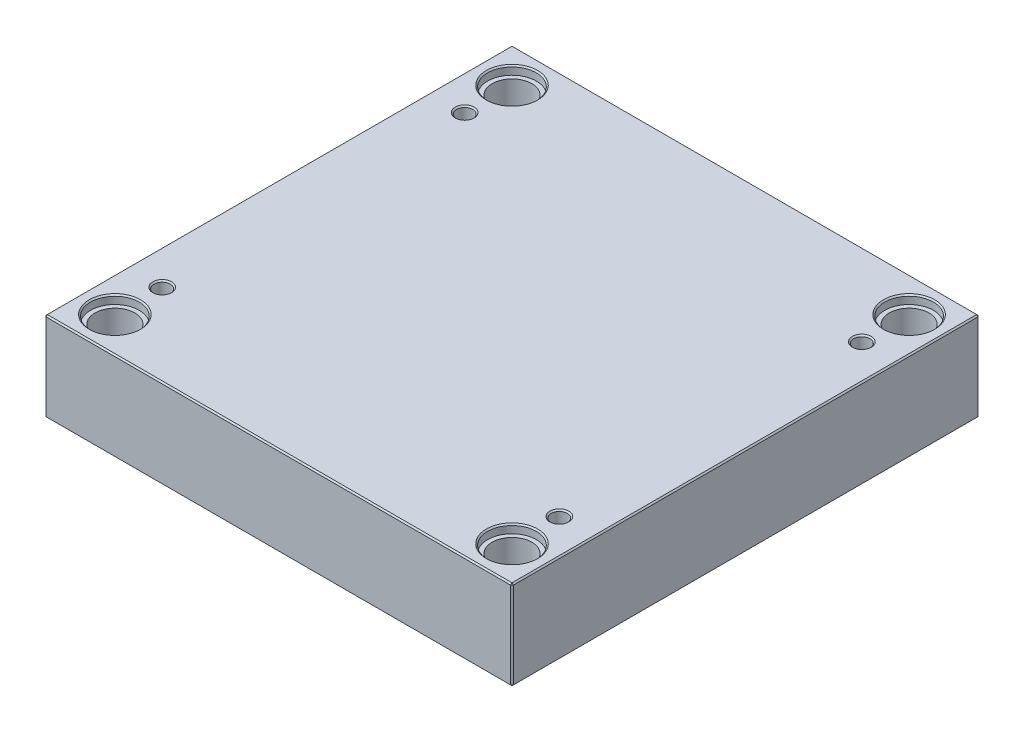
ISO-10303-21;
HEADER;
FILE_DESCRIPTION(('STEP AP214'),'2;1');
FILE_NAME('part.step','',(''),(''),'','','');
FILE_SCHEMA(('AUTOMOTIVE_DESIGN { 1 0 10303 214 1 1 1 1 }'));
ENDSEC;
DATA;
#1=APPLICATION_CONTEXT('core data for automotive mechanical design processes');
#2=APPLICATION_PROTOCOL_DEFINITION('international standard','automotive_design',2000,#1);
#3=PRODUCT_CONTEXT('',#1,'mechanical');
#4=PRODUCT('Part','Part','',(#3));
#5=PRODUCT_RELATED_PRODUCT_CATEGORY('part','',(#4));
#6=PRODUCT_DEFINITION_FORMATION('','',#4);
#7=PRODUCT_DEFINITION_CONTEXT('part definition',#1,'design');
#8=PRODUCT_DEFINITION('design','',#6,#7);
#9=PRODUCT_DEFINITION_SHAPE('','',#8);
#10=(LENGTH_UNIT() NAMED_UNIT(*) SI_UNIT(.MILLI.,.METRE.));
#11=(NAMED_UNIT(*) PLANE_ANGLE_UNIT() SI_UNIT($,.RADIAN.));
#12=(NAMED_UNIT(*) SI_UNIT($,.STERADIAN.) SOLID_ANGLE_UNIT());
#13=UNCERTAINTY_MEASURE_WITH_UNIT(LENGTH_MEASURE(1.E-05),#10,'distance_accuracy_value','');
#14=(GEOMETRIC_REPRESENTATION_CONTEXT(3) GLOBAL_UNCERTAINTY_ASSIGNED_CONTEXT((#13)) GLOBAL_UNIT_ASSIGNED_CONTEXT((#10,
#11,#12)) REPRESENTATION_CONTEXT('',''));
#15=CARTESIAN_POINT('',(0.,0.,0.));
#16=DIRECTION('',(0.,0.,1.));
#17=DIRECTION('',(1.,0.,0.));
#18=AXIS2_PLACEMENT_3D('',#15,#16,#17);
#19=CARTESIAN_POINT('',(-147.,0.,-147.));
#20=DIRECTION('',(0.,1.,0.));
#21=DIRECTION('',(0.,0.,1.));
#22=AXIS2_PLACEMENT_3D('',#19,#20,#21);
#23=CYLINDRICAL_SURFACE('',#22,14.7);
#24=CARTESIAN_POINT('',(-147.,0.999999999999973,-147.));
#25=DIRECTION('',(0.,1.,0.));
#26=DIRECTION('',(0.,0.,1.));
#27=AXIS2_PLACEMENT_3D('',#24,#25,#26);
#28=CIRCLE('',#27,14.7);
#29=CARTESIAN_POINT('',(-147.,0.999999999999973,-132.3));
#30=VERTEX_POINT('',#29);
#31=EDGE_CURVE('E472',#30,#30,#28,.F.);
#32=ORIENTED_EDGE('',*,*,#31,.T.);
#33=EDGE_LOOP('',(#32));
#34=FACE_BOUND('',#33,.T.);
#35=CARTESIAN_POINT('',(-147.,59.7,-147.));
#36=DIRECTION('',(0.,1.,0.));
#37=DIRECTION('',(0.,0.,1.));
#38=AXIS2_PLACEMENT_3D('',#35,#36,#37);
#39=CIRCLE('',#38,14.7);
#40=CARTESIAN_POINT('',(-147.,59.7,-132.3));
#41=VERTEX_POINT('',#40);
#42=EDGE_CURVE('E221',#41,#41,#39,.F.);
#43=ORIENTED_EDGE('',*,*,#42,.F.);
#44=EDGE_LOOP('',(#43));
#45=FACE_BOUND('',#44,.T.);
#46=ADVANCED_FACE('F16',(#34,#45),#23,.F.);
#47=CARTESIAN_POINT('',(147.,0.,-147.));
#48=DIRECTION('',(0.,1.,0.));
#49=DIRECTION('',(0.,0.,1.));
#50=AXIS2_PLACEMENT_3D('',#47,#48,#49);
#51=CYLINDRICAL_SURFACE('',#50,14.7);
#52=CARTESIAN_POINT('',(147.,0.999999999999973,-147.));
#53=DIRECTION('',(0.,1.,0.));
#54=DIRECTION('',(0.,0.,1.));
#55=AXIS2_PLACEMENT_3D('',#52,#53,#54);
#56=CIRCLE('',#55,14.7);
#57=CARTESIAN_POINT('',(147.,0.999999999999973,-132.3));
#58=VERTEX_POINT('',#57);
#59=EDGE_CURVE('E474',#58,#58,#56,.F.);
#60=ORIENTED_EDGE('',*,*,#59,.T.);
#61=EDGE_LOOP('',(#60));
#62=FACE_BOUND('',#61,.T.);
#63=CARTESIAN_POINT('',(147.,59.7,-147.));
#64=DIRECTION('',(0.,1.,0.));
#65=DIRECTION('',(0.,0.,1.));
#66=AXIS2_PLACEMENT_3D('',#63,#64,#65);
#67=CIRCLE('',#66,14.7);
#68=CARTESIAN_POINT('',(147.,59.7,-132.3));
#69=VERTEX_POINT('',#68);
#70=EDGE_CURVE('E218',#69,#69,#67,.F.);
#71=ORIENTED_EDGE('',*,*,#70,.F.);
#72=EDGE_LOOP('',(#71));
#73=FACE_BOUND('',#72,.T.);
#74=ADVANCED_FACE('F263',(#62,#73),#51,.F.);
#75=CARTESIAN_POINT('',(147.,0.,147.));
#76=DIRECTION('',(0.,1.,0.));
#77=DIRECTION('',(0.,0.,1.));
#78=AXIS2_PLACEMENT_3D('',#75,#76,#77);
#79=CYLINDRICAL_SURFACE('',#78,14.7);
#80=CARTESIAN_POINT('',(147.,0.999999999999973,147.));
#81=DIRECTION('',(0.,1.,0.));
#82=DIRECTION('',(0.,0.,1.));
#83=AXIS2_PLACEMENT_3D('',#80,#81,#82);
#84=CIRCLE('',#83,14.7);
#85=CARTESIAN_POINT('',(147.,0.999999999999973,161.7));
#86=VERTEX_POINT('',#85);
#87=EDGE_CURVE('E477',#86,#86,#84,.F.);
#88=ORIENTED_EDGE('',*,*,#87,.T.);
#89=EDGE_LOOP('',(#88));
#90=FACE_BOUND('',#89,.T.);
#91=CARTESIAN_POINT('',(147.,59.7,147.));
#92=DIRECTION('',(0.,1.,0.));
#93=DIRECTION('',(0.,0.,1.));
#94=AXIS2_PLACEMENT_3D('',#91,#92,#93);
#95=CIRCLE('',#94,14.7);
#96=CARTESIAN_POINT('',(147.,59.7,161.7));
#97=VERTEX_POINT('',#96);
#98=EDGE_CURVE('E214',#97,#97,#95,.F.);
#99=ORIENTED_EDGE('',*,*,#98,.F.);
#100=EDGE_LOOP('',(#99));
#101=FACE_BOUND('',#100,.T.);
#102=ADVANCED_FACE('F270',(#90,#101),#79,.F.);
#103=CARTESIAN_POINT('',(-147.,0.,147.));
#104=DIRECTION('',(0.,1.,0.));
#105=DIRECTION('',(0.,0.,1.));
#106=AXIS2_PLACEMENT_3D('',#103,#104,#105);
#107=CYLINDRICAL_SURFACE('',#106,14.7);
#108=CARTESIAN_POINT('',(-147.,0.999999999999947,147.));
#109=DIRECTION('',(0.,1.,0.));
#110=DIRECTION('',(0.,0.,1.));
#111=AXIS2_PLACEMENT_3D('',#108,#109,#110);
#112=CIRCLE('',#111,14.7);
#113=CARTESIAN_POINT('',(-147.,0.999999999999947,161.7));
#114=VERTEX_POINT('',#113);
#115=EDGE_CURVE('E480',#114,#114,#112,.F.);
#116=ORIENTED_EDGE('',*,*,#115,.T.);
#117=EDGE_LOOP('',(#116));
#118=FACE_BOUND('',#117,.T.);
#119=CARTESIAN_POINT('',(-147.,59.7,147.));
#120=DIRECTION('',(0.,1.,0.));
#121=DIRECTION('',(0.,0.,1.));
#122=AXIS2_PLACEMENT_3D('',#119,#120,#121);
#123=CIRCLE('',#122,14.7);
#124=CARTESIAN_POINT('',(-147.,59.7,161.7));
#125=VERTEX_POINT('',#124);
#126=EDGE_CURVE('E211',#125,#125,#123,.F.);
#127=ORIENTED_EDGE('',*,*,#126,.F.);
#128=EDGE_LOOP('',(#127));
#129=FACE_BOUND('',#128,.T.);
#130=ADVANCED_FACE('F277',(#118,#129),#107,.F.);
#131=CARTESIAN_POINT('',(-173.,66.,173.));
#132=DIRECTION('',(1.,0.,0.));
#133=DIRECTION('',(0.,0.,-1.));
#134=AXIS2_PLACEMENT_3D('',#131,#132,#133);
#135=PLANE('',#134);
#136=DIRECTION('',(0.,-1.,0.));
#137=VECTOR('',#136,1.);
#138=CARTESIAN_POINT('',(-173.,66.,-172.));
#139=LINE('',#138,#137);
#140=CARTESIAN_POINT('',(-173.,65.,-172.));
#141=VERTEX_POINT('',#140);
#142=CARTESIAN_POINT('',(-173.,1.,-172.));
#143=VERTEX_POINT('',#142);
#144=EDGE_CURVE('E487',#141,#143,#139,.T.);
#145=ORIENTED_EDGE('',*,*,#144,.T.);
#146=DIRECTION('',(0.,0.,1.));
#147=VECTOR('',#146,1.);
#148=CARTESIAN_POINT('',(-173.,1.,173.));
#149=LINE('',#148,#147);
#150=CARTESIAN_POINT('',(-173.,1.,172.));
#151=VERTEX_POINT('',#150);
#152=EDGE_CURVE('E490',#143,#151,#149,.T.);
#153=ORIENTED_EDGE('',*,*,#152,.T.);
#154=DIRECTION('',(0.,1.,0.));
#155=VECTOR('',#154,1.);
#156=CARTESIAN_POINT('',(-173.,66.,172.));
#157=LINE('',#156,#155);
#158=CARTESIAN_POINT('',(-173.,65.,172.));
#159=VERTEX_POINT('',#158);
#160=EDGE_CURVE('E485',#151,#159,#157,.T.);
#161=ORIENTED_EDGE('',*,*,#160,.T.);
#162=DIRECTION('',(0.,0.,-1.));
#163=VECTOR('',#162,1.);
#164=CARTESIAN_POINT('',(-173.,65.,-173.));
#165=LINE('',#164,#163);
#166=EDGE_CURVE('E483',#159,#141,#165,.T.);
#167=ORIENTED_EDGE('',*,*,#166,.T.);
#168=EDGE_LOOP('',(#145,#153,#161,#167));
#169=FACE_BOUND('',#168,.T.);
#170=ADVANCED_FACE('F298',(#169),#135,.F.);
#171=CARTESIAN_POINT('',(173.,66.,173.));
#172=DIRECTION('',(0.,0.,-1.));
#173=DIRECTION('',(-1.,0.,0.));
#174=AXIS2_PLACEMENT_3D('',#171,#172,#173);
#175=PLANE('',#174);
#176=DIRECTION('',(-1.,0.,0.));
#177=VECTOR('',#176,1.);
#178=CARTESIAN_POINT('',(-173.,65.,173.));
#179=LINE('',#178,#177);
#180=CARTESIAN_POINT('',(172.,65.,173.));
#181=VERTEX_POINT('',#180);
#182=CARTESIAN_POINT('',(-172.,65.,173.));
#183=VERTEX_POINT('',#182);
#184=EDGE_CURVE('E509',#181,#183,#179,.T.);
#185=ORIENTED_EDGE('',*,*,#184,.T.);
#186=DIRECTION('',(0.,-1.,0.));
#187=VECTOR('',#186,1.);
#188=CARTESIAN_POINT('',(-172.,66.,173.));
#189=LINE('',#188,#187);
#190=CARTESIAN_POINT('',(-172.,1.,173.));
#191=VERTEX_POINT('',#190);
#192=EDGE_CURVE('E515',#183,#191,#189,.T.);
#193=ORIENTED_EDGE('',*,*,#192,.T.);
#194=DIRECTION('',(1.,0.,0.));
#195=VECTOR('',#194,1.);
#196=CARTESIAN_POINT('',(173.,1.,173.));
#197=LINE('',#196,#195);
#198=CARTESIAN_POINT('',(172.,1.,173.));
#199=VERTEX_POINT('',#198);
#200=EDGE_CURVE('E513',#191,#199,#197,.T.);
#201=ORIENTED_EDGE('',*,*,#200,.T.);
#202=DIRECTION('',(0.,1.,0.));
#203=VECTOR('',#202,1.);
#204=CARTESIAN_POINT('',(172.,66.,173.));
#205=LINE('',#204,#203);
#206=EDGE_CURVE('E511',#199,#181,#205,.T.);
#207=ORIENTED_EDGE('',*,*,#206,.T.);
#208=EDGE_LOOP('',(#185,#193,#201,#207));
#209=FACE_BOUND('',#208,.T.);
#210=ADVANCED_FACE('F294',(#209),#175,.F.);
#211=CARTESIAN_POINT('',(173.,66.,173.));
#212=DIRECTION('',(-1.,0.,0.));
#213=DIRECTION('',(0.,0.,1.));
#214=AXIS2_PLACEMENT_3D('',#211,#212,#213);
#215=PLANE('',#214);
#216=DIRECTION('',(0.,0.,-1.));
#217=VECTOR('',#216,1.);
#218=CARTESIAN_POINT('',(173.,1.,173.));
#219=LINE('',#218,#217);
#220=CARTESIAN_POINT('',(173.,1.,172.));
#221=VERTEX_POINT('',#220);
#222=CARTESIAN_POINT('',(173.,1.,-172.));
#223=VERTEX_POINT('',#222);
#224=EDGE_CURVE('E504',#221,#223,#219,.T.);
#225=ORIENTED_EDGE('',*,*,#224,.T.);
#226=DIRECTION('',(0.,1.,0.));
#227=VECTOR('',#226,1.);
#228=CARTESIAN_POINT('',(173.,66.,-172.));
#229=LINE('',#228,#227);
#230=CARTESIAN_POINT('',(173.,65.,-172.));
#231=VERTEX_POINT('',#230);
#232=EDGE_CURVE('E506',#223,#231,#229,.T.);
#233=ORIENTED_EDGE('',*,*,#232,.T.);
#234=DIRECTION('',(0.,0.,1.));
#235=VECTOR('',#234,1.);
#236=CARTESIAN_POINT('',(173.,65.,173.));
#237=LINE('',#236,#235);
#238=CARTESIAN_POINT('',(173.,65.,172.));
#239=VERTEX_POINT('',#238);
#240=EDGE_CURVE('E500',#231,#239,#237,.T.);
#241=ORIENTED_EDGE('',*,*,#240,.T.);
#242=DIRECTION('',(0.,-1.,0.));
#243=VECTOR('',#242,1.);
#244=CARTESIAN_POINT('',(173.,66.,172.));
#245=LINE('',#244,#243);
#246=EDGE_CURVE('E502',#239,#221,#245,.T.);
#247=ORIENTED_EDGE('',*,*,#246,.T.);
#248=EDGE_LOOP('',(#225,#233,#241,#247));
#249=FACE_BOUND('',#248,.T.);
#250=ADVANCED_FACE('F290',(#249),#215,.F.);
#251=CARTESIAN_POINT('',(173.,66.,-173.));
#252=DIRECTION('',(0.,0.,1.));
#253=DIRECTION('',(1.,0.,0.));
#254=AXIS2_PLACEMENT_3D('',#251,#252,#253);
#255=PLANE('',#254);
#256=DIRECTION('',(0.,-1.,0.));
#257=VECTOR('',#256,1.);
#258=CARTESIAN_POINT('',(172.,66.,-173.));
#259=LINE('',#258,#257);
#260=CARTESIAN_POINT('',(172.,65.,-173.));
#261=VERTEX_POINT('',#260);
#262=CARTESIAN_POINT('',(172.,1.,-173.));
#263=VERTEX_POINT('',#262);
#264=EDGE_CURVE('E494',#261,#263,#259,.T.);
#265=ORIENTED_EDGE('',*,*,#264,.T.);
#266=DIRECTION('',(-1.,0.,0.));
#267=VECTOR('',#266,1.);
#268=CARTESIAN_POINT('',(173.,1.,-173.));
#269=LINE('',#268,#267);
#270=CARTESIAN_POINT('',(-172.,1.,-173.));
#271=VERTEX_POINT('',#270);
#272=EDGE_CURVE('E138',#263,#271,#269,.T.);
#273=ORIENTED_EDGE('',*,*,#272,.T.);
#274=DIRECTION('',(0.,1.,0.));
#275=VECTOR('',#274,1.);
#276=CARTESIAN_POINT('',(-172.,66.,-173.));
#277=LINE('',#276,#275);
#278=CARTESIAN_POINT('',(-172.,65.,-173.));
#279=VERTEX_POINT('',#278);
#280=EDGE_CURVE('E496',#271,#279,#277,.T.);
#281=ORIENTED_EDGE('',*,*,#280,.T.);
#282=DIRECTION('',(1.,0.,0.));
#283=VECTOR('',#282,1.);
#284=CARTESIAN_POINT('',(173.,65.,-173.));
#285=LINE('',#284,#283);
#286=EDGE_CURVE('E492',#279,#261,#285,.T.);
#287=ORIENTED_EDGE('',*,*,#286,.T.);
#288=EDGE_LOOP('',(#265,#273,#281,#287));
#289=FACE_BOUND('',#288,.T.);
#290=ADVANCED_FACE('F282',(#289),#255,.F.);
#291=CARTESIAN_POINT('',(0.,66.,0.));
#292=DIRECTION('',(0.,1.,0.));
#293=DIRECTION('',(0.,0.,1.));
#294=AXIS2_PLACEMENT_3D('',#291,#292,#293);
#295=PLANE('',#294);
#296=CARTESIAN_POINT('',(147.,66.,147.));
#297=DIRECTION('',(0.,1.,0.));
#298=DIRECTION('',(0.,0.,1.));
#299=AXIS2_PLACEMENT_3D('',#296,#297,#298);
#300=CIRCLE('',#299,19.);
#301=CARTESIAN_POINT('',(147.,66.,166.));
#302=VERTEX_POINT('',#301);
#303=EDGE_CURVE('E236',#302,#302,#300,.F.);
#304=ORIENTED_EDGE('',*,*,#303,.T.);
#305=EDGE_LOOP('',(#304));
#306=FACE_BOUND('',#305,.T.);
#307=CARTESIAN_POINT('',(-147.,66.,147.));
#308=DIRECTION('',(0.,1.,0.));
#309=DIRECTION('',(0.,0.,1.));
#310=AXIS2_PLACEMENT_3D('',#307,#308,#309);
#311=CIRCLE('',#310,19.);
#312=CARTESIAN_POINT('',(-147.,66.,166.));
#313=VERTEX_POINT('',#312);
#314=EDGE_CURVE('E233',#313,#313,#311,.F.);
#315=ORIENTED_EDGE('',*,*,#314,.T.);
#316=EDGE_LOOP('',(#315));
#317=FACE_BOUND('',#316,.T.);
#318=CARTESIAN_POINT('',(147.,66.,-147.));
#319=DIRECTION('',(0.,1.,0.));
#320=DIRECTION('',(0.,0.,1.));
#321=AXIS2_PLACEMENT_3D('',#318,#319,#320);
#322=CIRCLE('',#321,19.);
#323=CARTESIAN_POINT('',(147.,66.,-128.));
#324=VERTEX_POINT('',#323);
#325=EDGE_CURVE('E230',#324,#324,#322,.F.);
#326=ORIENTED_EDGE('',*,*,#325,.T.);
#327=EDGE_LOOP('',(#326));
#328=FACE_BOUND('',#327,.T.);
#329=CARTESIAN_POINT('',(-147.,66.,-147.));
#330=DIRECTION('',(0.,1.,0.));
#331=DIRECTION('',(0.,0.,1.));
#332=AXIS2_PLACEMENT_3D('',#329,#330,#331);
#333=CIRCLE('',#332,19.);
#334=CARTESIAN_POINT('',(-147.,66.,-128.));
#335=VERTEX_POINT('',#334);
#336=EDGE_CURVE('E227',#335,#335,#333,.F.);
#337=ORIENTED_EDGE('',*,*,#336,.T.);
#338=EDGE_LOOP('',(#337));
#339=FACE_BOUND('',#338,.T.);
#340=CARTESIAN_POINT('',(-147.,66.,112.));
#341=DIRECTION('',(0.,1.,0.));
#342=DIRECTION('',(0.,0.,1.));
#343=AXIS2_PLACEMENT_3D('',#340,#341,#342);
#344=CIRCLE('',#343,7.);
#345=CARTESIAN_POINT('',(-147.,66.,119.));
#346=VERTEX_POINT('',#345);
#347=EDGE_CURVE('E198',#346,#346,#344,.F.);
#348=ORIENTED_EDGE('',*,*,#347,.T.);
#349=EDGE_LOOP('',(#348));
#350=FACE_BOUND('',#349,.T.);
#351=CARTESIAN_POINT('',(147.,66.,112.));
#352=DIRECTION('',(0.,1.,0.));
#353=DIRECTION('',(0.,0.,1.));
#354=AXIS2_PLACEMENT_3D('',#351,#352,#353);
#355=CIRCLE('',#354,7.);
#356=CARTESIAN_POINT('',(147.,66.,119.));
#357=VERTEX_POINT('',#356);
#358=EDGE_CURVE('E195',#357,#357,#355,.F.);
#359=ORIENTED_EDGE('',*,*,#358,.T.);
#360=EDGE_LOOP('',(#359));
#361=FACE_BOUND('',#360,.T.);
#362=CARTESIAN_POINT('',(147.,66.,-112.));
#363=DIRECTION('',(0.,1.,0.));
#364=DIRECTION('',(0.,0.,1.));
#365=AXIS2_PLACEMENT_3D('',#362,#363,#364);
#366=CIRCLE('',#365,7.);
#367=CARTESIAN_POINT('',(147.,66.,-105.));
#368=VERTEX_POINT('',#367);
#369=EDGE_CURVE('E192',#368,#368,#366,.F.);
#370=ORIENTED_EDGE('',*,*,#369,.T.);
#371=EDGE_LOOP('',(#370));
#372=FACE_BOUND('',#371,.T.);
#373=CARTESIAN_POINT('',(-147.,66.,-112.));
#374=DIRECTION('',(0.,1.,0.));
#375=DIRECTION('',(0.,0.,1.));
#376=AXIS2_PLACEMENT_3D('',#373,#374,#375);
#377=CIRCLE('',#376,7.);
#378=CARTESIAN_POINT('',(-147.,66.,-105.));
#379=VERTEX_POINT('',#378);
#380=EDGE_CURVE('E188',#379,#379,#377,.F.);
#381=ORIENTED_EDGE('',*,*,#380,.T.);
#382=EDGE_LOOP('',(#381));
#383=FACE_BOUND('',#382,.T.);
#384=DIRECTION('',(0.,0.,-1.));
#385=VECTOR('',#384,1.);
#386=CARTESIAN_POINT('',(172.,66.,-173.));
#387=LINE('',#386,#385);
#388=CARTESIAN_POINT('',(172.,66.,172.));
#389=VERTEX_POINT('',#388);
#390=CARTESIAN_POINT('',(172.,66.,-172.));
#391=VERTEX_POINT('',#390);
#392=EDGE_CURVE('E31',#389,#391,#387,.T.);
#393=ORIENTED_EDGE('',*,*,#392,.T.);
#394=DIRECTION('',(-1.,0.,0.));
#395=VECTOR('',#394,1.);
#396=CARTESIAN_POINT('',(-173.,66.,-172.));
#397=LINE('',#396,#395);
#398=CARTESIAN_POINT('',(-172.,66.,-172.));
#399=VERTEX_POINT('',#398);
#400=EDGE_CURVE('E189',#391,#399,#397,.T.);
#401=ORIENTED_EDGE('',*,*,#400,.T.);
#402=DIRECTION('',(0.,0.,1.));
#403=VECTOR('',#402,1.);
#404=CARTESIAN_POINT('',(-172.,66.,173.));
#405=LINE('',#404,#403);
#406=CARTESIAN_POINT('',(-172.,66.,172.));
#407=VERTEX_POINT('',#406);
#408=EDGE_CURVE('E518',#399,#407,#405,.T.);
#409=ORIENTED_EDGE('',*,*,#408,.T.);
#410=DIRECTION('',(1.,0.,0.));
#411=VECTOR('',#410,1.);
#412=CARTESIAN_POINT('',(173.,66.,172.));
#413=LINE('',#412,#411);
#414=EDGE_CURVE('E36',#407,#389,#413,.T.);
#415=ORIENTED_EDGE('',*,*,#414,.T.);
#416=EDGE_LOOP('',(#393,#401,#409,#415));
#417=FACE_BOUND('',#416,.T.);
#418=ADVANCED_FACE('F279',(#306,#317,#328,#339,#350,#361,#372,#383,#417),#295,.T.);
#419=CARTESIAN_POINT('',(0.,0.,0.));
#420=DIRECTION('',(0.,1.,0.));
#421=DIRECTION('',(0.,0.,1.));
#422=AXIS2_PLACEMENT_3D('',#419,#420,#421);
#423=PLANE('',#422);
#424=CARTESIAN_POINT('',(-147.,0.,-147.));
#425=DIRECTION('',(0.,1.,0.));
#426=DIRECTION('',(0.,0.,1.));
#427=AXIS2_PLACEMENT_3D('',#424,#425,#426);
#428=CIRCLE('',#427,15.7);
#429=CARTESIAN_POINT('',(-147.,0.,-131.3));
#430=VERTEX_POINT('',#429);
#431=EDGE_CURVE('E469',#430,#430,#428,.T.);
#432=ORIENTED_EDGE('',*,*,#431,.T.);
#433=EDGE_LOOP('',(#432));
#434=FACE_BOUND('',#433,.T.);
#435=CARTESIAN_POINT('',(147.,0.,-147.));
#436=DIRECTION('',(0.,1.,0.));
#437=DIRECTION('',(0.,0.,1.));
#438=AXIS2_PLACEMENT_3D('',#435,#436,#437);
#439=CIRCLE('',#438,15.7);
#440=CARTESIAN_POINT('',(147.,0.,-131.3));
#441=VERTEX_POINT('',#440);
#442=EDGE_CURVE('E466',#441,#441,#439,.T.);
#443=ORIENTED_EDGE('',*,*,#442,.T.);
#444=EDGE_LOOP('',(#443));
#445=FACE_BOUND('',#444,.T.);
#446=CARTESIAN_POINT('',(147.,0.,147.));
#447=DIRECTION('',(0.,1.,0.));
#448=DIRECTION('',(0.,0.,1.));
#449=AXIS2_PLACEMENT_3D('',#446,#447,#448);
#450=CIRCLE('',#449,15.7);
#451=CARTESIAN_POINT('',(147.,0.,162.7));
#452=VERTEX_POINT('',#451);
#453=EDGE_CURVE('E463',#452,#452,#450,.T.);
#454=ORIENTED_EDGE('',*,*,#453,.T.);
#455=EDGE_LOOP('',(#454));
#456=FACE_BOUND('',#455,.T.);
#457=CARTESIAN_POINT('',(-147.,0.,147.));
#458=DIRECTION('',(0.,1.,0.));
#459=DIRECTION('',(0.,0.,1.));
#460=AXIS2_PLACEMENT_3D('',#457,#458,#459);
#461=CIRCLE('',#460,15.7);
#462=CARTESIAN_POINT('',(-147.,0.,162.7));
#463=VERTEX_POINT('',#462);
#464=EDGE_CURVE('E460',#463,#463,#461,.T.);
#465=ORIENTED_EDGE('',*,*,#464,.T.);
#466=EDGE_LOOP('',(#465));
#467=FACE_BOUND('',#466,.T.);
#468=DIRECTION('',(0.,0.,1.));
#469=VECTOR('',#468,1.);
#470=CARTESIAN_POINT('',(172.,0.,0.));
#471=LINE('',#470,#469);
#472=CARTESIAN_POINT('',(172.,0.,-172.));
#473=VERTEX_POINT('',#472);
#474=CARTESIAN_POINT('',(172.,0.,172.));
#475=VERTEX_POINT('',#474);
#476=EDGE_CURVE('E108',#473,#475,#471,.T.);
#477=ORIENTED_EDGE('',*,*,#476,.T.);
#478=DIRECTION('',(-1.,0.,0.));
#479=VECTOR('',#478,1.);
#480=CARTESIAN_POINT('',(0.,0.,172.));
#481=LINE('',#480,#479);
#482=CARTESIAN_POINT('',(-172.,0.,172.));
#483=VERTEX_POINT('',#482);
#484=EDGE_CURVE('E458',#475,#483,#481,.T.);
#485=ORIENTED_EDGE('',*,*,#484,.T.);
#486=DIRECTION('',(0.,0.,-1.));
#487=VECTOR('',#486,1.);
#488=CARTESIAN_POINT('',(-172.,0.,0.));
#489=LINE('',#488,#487);
#490=CARTESIAN_POINT('',(-172.,0.,-172.));
#491=VERTEX_POINT('',#490);
#492=EDGE_CURVE('E110',#483,#491,#489,.T.);
#493=ORIENTED_EDGE('',*,*,#492,.T.);
#494=DIRECTION('',(1.,0.,0.));
#495=VECTOR('',#494,1.);
#496=CARTESIAN_POINT('',(0.,0.,-172.));
#497=LINE('',#496,#495);
#498=EDGE_CURVE('E104',#491,#473,#497,.T.);
#499=ORIENTED_EDGE('',*,*,#498,.T.);
#500=EDGE_LOOP('',(#477,#485,#493,#499));
#501=FACE_BOUND('',#500,.T.);
#502=ADVANCED_FACE('F106',(#434,#445,#456,#467,#501),#423,.F.);
#503=CARTESIAN_POINT('',(-147.,0.,-147.));
#504=DIRECTION('',(0.,-1.,0.));
#505=DIRECTION('',(0.,0.,-1.));
#506=AXIS2_PLACEMENT_3D('',#503,#504,#505);
#507=CONICAL_SURFACE('',#506,15.7,0.78539816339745);
#508=ORIENTED_EDGE('',*,*,#31,.F.);
#509=EDGE_LOOP('',(#508));
#510=FACE_BOUND('',#509,.T.);
#511=ORIENTED_EDGE('',*,*,#431,.F.);
#512=EDGE_LOOP('',(#511));
#513=FACE_BOUND('',#512,.T.);
#514=ADVANCED_FACE('F286',(#510,#513),#507,.F.);
#515=CARTESIAN_POINT('',(147.,0.,-147.));
#516=DIRECTION('',(0.,-1.,0.));
#517=DIRECTION('',(0.,0.,-1.));
#518=AXIS2_PLACEMENT_3D('',#515,#516,#517);
#519=CONICAL_SURFACE('',#518,15.7,0.78539816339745);
#520=ORIENTED_EDGE('',*,*,#59,.F.);
#521=EDGE_LOOP('',(#520));
#522=FACE_BOUND('',#521,.T.);
#523=ORIENTED_EDGE('',*,*,#442,.F.);
#524=EDGE_LOOP('',(#523));
#525=FACE_BOUND('',#524,.T.);
#526=ADVANCED_FACE('F305',(#522,#525),#519,.F.);
#527=CARTESIAN_POINT('',(147.,0.,147.));
#528=DIRECTION('',(0.,-1.,0.));
#529=DIRECTION('',(0.,0.,-1.));
#530=AXIS2_PLACEMENT_3D('',#527,#528,#529);
#531=CONICAL_SURFACE('',#530,15.7,0.78539816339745);
#532=ORIENTED_EDGE('',*,*,#87,.F.);
#533=EDGE_LOOP('',(#532));
#534=FACE_BOUND('',#533,.T.);
#535=ORIENTED_EDGE('',*,*,#453,.F.);
#536=EDGE_LOOP('',(#535));
#537=FACE_BOUND('',#536,.T.);
#538=ADVANCED_FACE('F309',(#534,#537),#531,.F.);
#539=CARTESIAN_POINT('',(-147.,0.,147.));
#540=DIRECTION('',(0.,-1.,0.));
#541=DIRECTION('',(0.,0.,-1.));
#542=AXIS2_PLACEMENT_3D('',#539,#540,#541);
#543=CONICAL_SURFACE('',#542,15.7,0.78539816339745);
#544=ORIENTED_EDGE('',*,*,#115,.F.);
#545=EDGE_LOOP('',(#544));
#546=FACE_BOUND('',#545,.T.);
#547=ORIENTED_EDGE('',*,*,#464,.F.);
#548=EDGE_LOOP('',(#547));
#549=FACE_BOUND('',#548,.T.);
#550=ADVANCED_FACE('F313',(#546,#549),#543,.F.);
#551=CARTESIAN_POINT('',(173.,66.,172.));
#552=DIRECTION('',(-0.707106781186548,0.,-0.707106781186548));
#553=DIRECTION('',(0.,-1.,0.));
#554=AXIS2_PLACEMENT_3D('',#551,#552,#553);
#555=PLANE('',#554);
#556=DIRECTION('',(-0.707106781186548,0.,0.707106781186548));
#557=VECTOR('',#556,1.);
#558=CARTESIAN_POINT('',(172.,65.,173.));
#559=LINE('',#558,#557);
#560=EDGE_CURVE('E126',#181,#239,#559,.F.);
#561=ORIENTED_EDGE('',*,*,#560,.F.);
#562=ORIENTED_EDGE('',*,*,#206,.F.);
#563=DIRECTION('',(0.707106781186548,0.,-0.707106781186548));
#564=VECTOR('',#563,1.);
#565=CARTESIAN_POINT('',(172.,1.,173.));
#566=LINE('',#565,#564);
#567=EDGE_CURVE('E180',#221,#199,#566,.F.);
#568=ORIENTED_EDGE('',*,*,#567,.F.);
#569=ORIENTED_EDGE('',*,*,#246,.F.);
#570=EDGE_LOOP('',(#561,#562,#568,#569));
#571=FACE_BOUND('',#570,.T.);
#572=ADVANCED_FACE('F317',(#571),#555,.F.);
#573=CARTESIAN_POINT('',(172.,65.,173.));
#574=DIRECTION('',(0.57735026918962,0.577350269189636,0.57735026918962));
#575=DIRECTION('',(0.,-0.707106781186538,0.707106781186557));
#576=AXIS2_PLACEMENT_3D('',#573,#574,#575);
#577=PLANE('',#576);
#578=DIRECTION('',(0.,-0.707106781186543,0.707106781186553));
#579=VECTOR('',#578,1.);
#580=CARTESIAN_POINT('',(172.,65.,173.));
#581=LINE('',#580,#579);
#582=EDGE_CURVE('E175',#181,#389,#581,.F.);
#583=ORIENTED_EDGE('',*,*,#582,.F.);
#584=ORIENTED_EDGE('',*,*,#560,.T.);
#585=DIRECTION('',(-0.707106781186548,0.707106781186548,0.));
#586=VECTOR('',#585,1.);
#587=CARTESIAN_POINT('',(172.5,65.5,172.));
#588=LINE('',#587,#586);
#589=EDGE_CURVE('E177',#389,#239,#588,.F.);
#590=ORIENTED_EDGE('',*,*,#589,.F.);
#591=EDGE_LOOP('',(#583,#584,#590));
#592=FACE_BOUND('',#591,.T.);
#593=ADVANCED_FACE('F385',(#592),#577,.T.);
#594=CARTESIAN_POINT('',(172.,1.,173.));
#595=DIRECTION('',(0.57735026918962,-0.577350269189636,0.57735026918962));
#596=DIRECTION('',(0.,-0.707106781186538,-0.707106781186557));
#597=AXIS2_PLACEMENT_3D('',#594,#595,#596);
#598=PLANE('',#597);
#599=DIRECTION('',(-0.707106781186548,-0.707106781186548,0.));
#600=VECTOR('',#599,1.);
#601=CARTESIAN_POINT('',(172.5,0.500000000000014,172.));
#602=LINE('',#601,#600);
#603=EDGE_CURVE('E124',#221,#475,#602,.T.);
#604=ORIENTED_EDGE('',*,*,#603,.F.);
#605=ORIENTED_EDGE('',*,*,#567,.T.);
#606=DIRECTION('',(0.,0.707106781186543,0.707106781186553));
#607=VECTOR('',#606,1.);
#608=CARTESIAN_POINT('',(172.,1.,173.));
#609=LINE('',#608,#607);
#610=EDGE_CURVE('E172',#475,#199,#609,.T.);
#611=ORIENTED_EDGE('',*,*,#610,.F.);
#612=EDGE_LOOP('',(#604,#605,#611));
#613=FACE_BOUND('',#612,.T.);
#614=ADVANCED_FACE('F381',(#613),#598,.T.);
#615=CARTESIAN_POINT('',(172.,66.,0.));
#616=DIRECTION('',(0.707106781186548,0.707106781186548,0.));
#617=DIRECTION('',(0.,0.,1.));
#618=AXIS2_PLACEMENT_3D('',#615,#616,#617);
#619=PLANE('',#618);
#620=ORIENTED_EDGE('',*,*,#589,.T.);
#621=ORIENTED_EDGE('',*,*,#240,.F.);
#622=DIRECTION('',(0.707106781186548,-0.707106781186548,0.));
#623=VECTOR('',#622,1.);
#624=CARTESIAN_POINT('',(173.,65.,-172.));
#625=LINE('',#624,#623);
#626=EDGE_CURVE('E166',#391,#231,#625,.T.);
#627=ORIENTED_EDGE('',*,*,#626,.F.);
#628=ORIENTED_EDGE('',*,*,#392,.F.);
#629=EDGE_LOOP('',(#620,#621,#627,#628));
#630=FACE_BOUND('',#629,.T.);
#631=ADVANCED_FACE('F377',(#630),#619,.T.);
#632=CARTESIAN_POINT('',(0.,66.,172.));
#633=DIRECTION('',(0.,0.707106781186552,0.707106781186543));
#634=DIRECTION('',(-1.,0.,0.));
#635=AXIS2_PLACEMENT_3D('',#632,#633,#634);
#636=PLANE('',#635);
#637=ORIENTED_EDGE('',*,*,#582,.T.);
#638=ORIENTED_EDGE('',*,*,#414,.F.);
#639=DIRECTION('',(0.,0.707106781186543,-0.707106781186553));
#640=VECTOR('',#639,1.);
#641=CARTESIAN_POINT('',(-172.,65.5,172.5));
#642=LINE('',#641,#640);
#643=EDGE_CURVE('E163',#183,#407,#642,.T.);
#644=ORIENTED_EDGE('',*,*,#643,.F.);
#645=ORIENTED_EDGE('',*,*,#184,.F.);
#646=EDGE_LOOP('',(#637,#638,#644,#645));
#647=FACE_BOUND('',#646,.T.);
#648=ADVANCED_FACE('F373',(#647),#636,.T.);
#649=CARTESIAN_POINT('',(-172.,66.,173.));
#650=DIRECTION('',(0.707106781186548,0.,-0.707106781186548));
#651=DIRECTION('',(0.,-1.,0.));
#652=AXIS2_PLACEMENT_3D('',#649,#650,#651);
#653=PLANE('',#652);
#654=DIRECTION('',(0.707106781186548,0.,0.707106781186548));
#655=VECTOR('',#654,1.);
#656=CARTESIAN_POINT('',(-172.,1.,173.));
#657=LINE('',#656,#655);
#658=EDGE_CURVE('E157',#191,#151,#657,.F.);
#659=ORIENTED_EDGE('',*,*,#658,.F.);
#660=ORIENTED_EDGE('',*,*,#192,.F.);
#661=DIRECTION('',(-0.707106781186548,0.,-0.707106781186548));
#662=VECTOR('',#661,1.);
#663=CARTESIAN_POINT('',(-173.,65.,172.));
#664=LINE('',#663,#662);
#665=EDGE_CURVE('E160',#159,#183,#664,.F.);
#666=ORIENTED_EDGE('',*,*,#665,.F.);
#667=ORIENTED_EDGE('',*,*,#160,.F.);
#668=EDGE_LOOP('',(#659,#660,#666,#667));
#669=FACE_BOUND('',#668,.T.);
#670=ADVANCED_FACE('F369',(#669),#653,.F.);
#671=CARTESIAN_POINT('',(173.,1.,173.));
#672=DIRECTION('',(0.,0.707106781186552,-0.707106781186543));
#673=DIRECTION('',(1.,0.,0.));
#674=AXIS2_PLACEMENT_3D('',#671,#672,#673);
#675=PLANE('',#674);
#676=ORIENTED_EDGE('',*,*,#610,.T.);
#677=ORIENTED_EDGE('',*,*,#200,.F.);
#678=DIRECTION('',(0.,-0.707106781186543,-0.707106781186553));
#679=VECTOR('',#678,1.);
#680=CARTESIAN_POINT('',(-172.,1.,173.));
#681=LINE('',#680,#679);
#682=EDGE_CURVE('E135',#483,#191,#681,.F.);
#683=ORIENTED_EDGE('',*,*,#682,.F.);
#684=ORIENTED_EDGE('',*,*,#484,.F.);
#685=EDGE_LOOP('',(#676,#677,#683,#684));
#686=FACE_BOUND('',#685,.T.);
#687=ADVANCED_FACE('F366',(#686),#675,.F.);
#688=CARTESIAN_POINT('',(173.,1.,173.));
#689=DIRECTION('',(-0.707106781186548,0.707106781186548,0.));
#690=DIRECTION('',(0.,0.,-1.));
#691=AXIS2_PLACEMENT_3D('',#688,#689,#690);
#692=PLANE('',#691);
#693=ORIENTED_EDGE('',*,*,#603,.T.);
#694=ORIENTED_EDGE('',*,*,#476,.F.);
#695=DIRECTION('',(0.707106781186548,0.707106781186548,0.));
#696=VECTOR('',#695,1.);
#697=CARTESIAN_POINT('',(172.5,0.5,-172.));
#698=LINE('',#697,#696);
#699=EDGE_CURVE('E121',#223,#473,#698,.F.);
#700=ORIENTED_EDGE('',*,*,#699,.F.);
#701=ORIENTED_EDGE('',*,*,#224,.F.);
#702=EDGE_LOOP('',(#693,#694,#700,#701));
#703=FACE_BOUND('',#702,.T.);
#704=ADVANCED_FACE('F119',(#703),#692,.F.);
#705=CARTESIAN_POINT('',(172.,66.,-173.));
#706=DIRECTION('',(-0.707106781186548,0.,0.707106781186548));
#707=DIRECTION('',(0.,-1.,0.));
#708=AXIS2_PLACEMENT_3D('',#705,#706,#707);
#709=PLANE('',#708);
#710=DIRECTION('',(0.707106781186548,0.,0.707106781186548));
#711=VECTOR('',#710,1.);
#712=CARTESIAN_POINT('',(173.,65.,-172.));
#713=LINE('',#712,#711);
#714=EDGE_CURVE('E168',#231,#261,#713,.F.);
#715=ORIENTED_EDGE('',*,*,#714,.F.);
#716=ORIENTED_EDGE('',*,*,#232,.F.);
#717=DIRECTION('',(-0.707106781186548,0.,-0.707106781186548));
#718=VECTOR('',#717,1.);
#719=CARTESIAN_POINT('',(172.,1.,-173.));
#720=LINE('',#719,#718);
#721=EDGE_CURVE('E134',#263,#223,#720,.F.);
#722=ORIENTED_EDGE('',*,*,#721,.F.);
#723=ORIENTED_EDGE('',*,*,#264,.F.);
#724=EDGE_LOOP('',(#715,#716,#722,#723));
#725=FACE_BOUND('',#724,.T.);
#726=ADVANCED_FACE('F359',(#725),#709,.F.);
#727=CARTESIAN_POINT('',(173.,65.,-172.));
#728=DIRECTION('',(0.577350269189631,0.577350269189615,-0.577350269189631));
#729=DIRECTION('',(-0.707106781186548,0.,-0.707106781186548));
#730=AXIS2_PLACEMENT_3D('',#727,#728,#729);
#731=PLANE('',#730);
#732=ORIENTED_EDGE('',*,*,#626,.T.);
#733=ORIENTED_EDGE('',*,*,#714,.T.);
#734=DIRECTION('',(0.,0.707106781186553,0.707106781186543));
#735=VECTOR('',#734,1.);
#736=CARTESIAN_POINT('',(172.,65.5,-172.5));
#737=LINE('',#736,#735);
#738=EDGE_CURVE('E152',#391,#261,#737,.F.);
#739=ORIENTED_EDGE('',*,*,#738,.F.);
#740=EDGE_LOOP('',(#732,#733,#739));
#741=FACE_BOUND('',#740,.T.);
#742=ADVANCED_FACE('F355',(#741),#731,.T.);
#743=CARTESIAN_POINT('',(-173.,65.,172.));
#744=DIRECTION('',(-0.57735026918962,0.577350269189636,0.57735026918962));
#745=DIRECTION('',(0.,-0.707106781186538,0.707106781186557));
#746=AXIS2_PLACEMENT_3D('',#743,#744,#745);
#747=PLANE('',#746);
#748=ORIENTED_EDGE('',*,*,#665,.T.);
#749=ORIENTED_EDGE('',*,*,#643,.T.);
#750=DIRECTION('',(-0.707106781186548,-0.707106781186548,0.));
#751=VECTOR('',#750,1.);
#752=CARTESIAN_POINT('',(-173.,65.,172.));
#753=LINE('',#752,#751);
#754=EDGE_CURVE('E143',#159,#407,#753,.F.);
#755=ORIENTED_EDGE('',*,*,#754,.F.);
#756=EDGE_LOOP('',(#748,#749,#755));
#757=FACE_BOUND('',#756,.T.);
#758=ADVANCED_FACE('F351',(#757),#747,.T.);
#759=CARTESIAN_POINT('',(-172.,1.,173.));
#760=DIRECTION('',(-0.57735026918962,-0.577350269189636,0.57735026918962));
#761=DIRECTION('',(0.,-0.707106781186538,-0.707106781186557));
#762=AXIS2_PLACEMENT_3D('',#759,#760,#761);
#763=PLANE('',#762);
#764=ORIENTED_EDGE('',*,*,#682,.T.);
#765=ORIENTED_EDGE('',*,*,#658,.T.);
#766=DIRECTION('',(-0.707106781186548,0.707106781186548,0.));
#767=VECTOR('',#766,1.);
#768=CARTESIAN_POINT('',(-172.5,0.500000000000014,172.));
#769=LINE('',#768,#767);
#770=EDGE_CURVE('E139',#483,#151,#769,.T.);
#771=ORIENTED_EDGE('',*,*,#770,.F.);
#772=EDGE_LOOP('',(#764,#765,#771));
#773=FACE_BOUND('',#772,.T.);
#774=ADVANCED_FACE('F348',(#773),#763,.T.);
#775=CARTESIAN_POINT('',(172.,1.,-173.));
#776=DIRECTION('',(0.577350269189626,-0.577350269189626,-0.577350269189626));
#777=DIRECTION('',(-0.707106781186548,0.,-0.707106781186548));
#778=AXIS2_PLACEMENT_3D('',#775,#776,#777);
#779=PLANE('',#778);
#780=ORIENTED_EDGE('',*,*,#721,.T.);
#781=ORIENTED_EDGE('',*,*,#699,.T.);
#782=DIRECTION('',(0.,-0.707106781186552,0.707106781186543));
#783=VECTOR('',#782,1.);
#784=CARTESIAN_POINT('',(172.,1.,-173.));
#785=LINE('',#784,#783);
#786=EDGE_CURVE('E131',#263,#473,#785,.T.);
#787=ORIENTED_EDGE('',*,*,#786,.F.);
#788=EDGE_LOOP('',(#780,#781,#787));
#789=FACE_BOUND('',#788,.T.);
#790=ADVANCED_FACE('F130',(#789),#779,.T.);
#791=CARTESIAN_POINT('',(0.,66.,-172.));
#792=DIRECTION('',(0.,0.707106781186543,-0.707106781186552));
#793=DIRECTION('',(1.,0.,0.));
#794=AXIS2_PLACEMENT_3D('',#791,#792,#793);
#795=PLANE('',#794);
#796=ORIENTED_EDGE('',*,*,#738,.T.);
#797=ORIENTED_EDGE('',*,*,#286,.F.);
#798=DIRECTION('',(0.,-0.707106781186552,-0.707106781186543));
#799=VECTOR('',#798,1.);
#800=CARTESIAN_POINT('',(-172.,65.,-173.));
#801=LINE('',#800,#799);
#802=EDGE_CURVE('E140',#399,#279,#801,.T.);
#803=ORIENTED_EDGE('',*,*,#802,.F.);
#804=ORIENTED_EDGE('',*,*,#400,.F.);
#805=EDGE_LOOP('',(#796,#797,#803,#804));
#806=FACE_BOUND('',#805,.T.);
#807=ADVANCED_FACE('F341',(#806),#795,.T.);
#808=CARTESIAN_POINT('',(-172.,66.,0.));
#809=DIRECTION('',(-0.707106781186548,0.707106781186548,0.));
#810=DIRECTION('',(0.,0.,-1.));
#811=AXIS2_PLACEMENT_3D('',#808,#809,#810);
#812=PLANE('',#811);
#813=ORIENTED_EDGE('',*,*,#754,.T.);
#814=ORIENTED_EDGE('',*,*,#408,.F.);
#815=DIRECTION('',(0.707106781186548,0.707106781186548,0.));
#816=VECTOR('',#815,1.);
#817=CARTESIAN_POINT('',(-172.5,65.5,-172.));
#818=LINE('',#817,#816);
#819=EDGE_CURVE('E146',#141,#399,#818,.T.);
#820=ORIENTED_EDGE('',*,*,#819,.F.);
#821=ORIENTED_EDGE('',*,*,#166,.F.);
#822=EDGE_LOOP('',(#813,#814,#820,#821));
#823=FACE_BOUND('',#822,.T.);
#824=ADVANCED_FACE('F337',(#823),#812,.T.);
#825=CARTESIAN_POINT('',(-173.,1.,173.));
#826=DIRECTION('',(0.707106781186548,0.707106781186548,0.));
#827=DIRECTION('',(0.,0.,1.));
#828=AXIS2_PLACEMENT_3D('',#825,#826,#827);
#829=PLANE('',#828);
#830=ORIENTED_EDGE('',*,*,#770,.T.);
#831=ORIENTED_EDGE('',*,*,#152,.F.);
#832=DIRECTION('',(0.707106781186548,-0.707106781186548,0.));
#833=VECTOR('',#832,1.);
#834=CARTESIAN_POINT('',(-173.,1.,-172.));
#835=LINE('',#834,#833);
#836=EDGE_CURVE('E529',#491,#143,#835,.F.);
#837=ORIENTED_EDGE('',*,*,#836,.F.);
#838=ORIENTED_EDGE('',*,*,#492,.F.);
#839=EDGE_LOOP('',(#830,#831,#837,#838));
#840=FACE_BOUND('',#839,.T.);
#841=ADVANCED_FACE('F334',(#840),#829,.F.);
#842=CARTESIAN_POINT('',(173.,1.,-173.));
#843=DIRECTION('',(0.,0.707106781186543,0.707106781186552));
#844=DIRECTION('',(-1.,0.,0.));
#845=AXIS2_PLACEMENT_3D('',#842,#843,#844);
#846=PLANE('',#845);
#847=ORIENTED_EDGE('',*,*,#786,.T.);
#848=ORIENTED_EDGE('',*,*,#498,.F.);
#849=DIRECTION('',(0.,0.707106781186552,-0.707106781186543));
#850=VECTOR('',#849,1.);
#851=CARTESIAN_POINT('',(-172.,0.500000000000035,-172.5));
#852=LINE('',#851,#850);
#853=EDGE_CURVE('E526',#271,#491,#852,.F.);
#854=ORIENTED_EDGE('',*,*,#853,.F.);
#855=ORIENTED_EDGE('',*,*,#272,.F.);
#856=EDGE_LOOP('',(#847,#848,#854,#855));
#857=FACE_BOUND('',#856,.T.);
#858=ADVANCED_FACE('F137',(#857),#846,.F.);
#859=CARTESIAN_POINT('',(-172.,65.,-173.));
#860=DIRECTION('',(-0.57735026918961,0.577350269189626,-0.577350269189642));
#861=DIRECTION('',(0.,0.707106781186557,0.707106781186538));
#862=AXIS2_PLACEMENT_3D('',#859,#860,#861);
#863=PLANE('',#862);
#864=ORIENTED_EDGE('',*,*,#819,.T.);
#865=ORIENTED_EDGE('',*,*,#802,.T.);
#866=DIRECTION('',(0.707106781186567,0.,-0.707106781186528));
#867=VECTOR('',#866,1.);
#868=CARTESIAN_POINT('',(-172.,65.,-173.));
#869=LINE('',#868,#867);
#870=EDGE_CURVE('E524',#141,#279,#869,.T.);
#871=ORIENTED_EDGE('',*,*,#870,.F.);
#872=EDGE_LOOP('',(#864,#865,#871));
#873=FACE_BOUND('',#872,.T.);
#874=ADVANCED_FACE('F327',(#873),#863,.T.);
#875=CARTESIAN_POINT('',(-173.,1.,-172.));
#876=DIRECTION('',(-0.577350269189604,-0.577350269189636,-0.577350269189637));
#877=DIRECTION('',(0.,0.707106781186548,-0.707106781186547));
#878=AXIS2_PLACEMENT_3D('',#875,#876,#877);
#879=PLANE('',#878);
#880=ORIENTED_EDGE('',*,*,#853,.T.);
#881=ORIENTED_EDGE('',*,*,#836,.T.);
#882=DIRECTION('',(-0.707106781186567,0.,0.707106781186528));
#883=VECTOR('',#882,1.);
#884=CARTESIAN_POINT('',(-173.,1.,-172.));
#885=LINE('',#884,#883);
#886=EDGE_CURVE('E455',#271,#143,#885,.T.);
#887=ORIENTED_EDGE('',*,*,#886,.F.);
#888=EDGE_LOOP('',(#880,#881,#887));
#889=FACE_BOUND('',#888,.T.);
#890=ADVANCED_FACE('F323',(#889),#879,.T.);
#891=CARTESIAN_POINT('',(-173.,66.,-172.));
#892=DIRECTION('',(0.707106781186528,0.,0.707106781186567));
#893=DIRECTION('',(0.,-1.,0.));
#894=AXIS2_PLACEMENT_3D('',#891,#892,#893);
#895=PLANE('',#894);
#896=ORIENTED_EDGE('',*,*,#870,.T.);
#897=ORIENTED_EDGE('',*,*,#280,.F.);
#898=ORIENTED_EDGE('',*,*,#886,.T.);
#899=ORIENTED_EDGE('',*,*,#144,.F.);
#900=EDGE_LOOP('',(#896,#897,#898,#899));
#901=FACE_BOUND('',#900,.T.);
#902=ADVANCED_FACE('F319',(#901),#895,.F.);
#903=CARTESIAN_POINT('',(-147.,42.,-112.));
#904=DIRECTION('',(0.,1.,0.));
#905=DIRECTION('',(0.,0.,1.));
#906=AXIS2_PLACEMENT_3D('',#903,#904,#905);
#907=CYLINDRICAL_SURFACE('',#906,6.);
#908=CARTESIAN_POINT('',(-147.,65.,-112.));
#909=DIRECTION('',(0.,1.,0.));
#910=DIRECTION('',(0.,0.,1.));
#911=AXIS2_PLACEMENT_3D('',#908,#909,#910);
#912=CIRCLE('',#911,6.);
#913=CARTESIAN_POINT('',(-147.,65.,-106.));
#914=VERTEX_POINT('',#913);
#915=EDGE_CURVE('E207',#914,#914,#912,.T.);
#916=ORIENTED_EDGE('',*,*,#915,.T.);
#917=EDGE_LOOP('',(#916));
#918=FACE_BOUND('',#917,.T.);
#919=CARTESIAN_POINT('',(-147.,42.,-112.));
#920=DIRECTION('',(0.,1.,0.));
#921=DIRECTION('',(0.,0.,1.));
#922=AXIS2_PLACEMENT_3D('',#919,#920,#921);
#923=CIRCLE('',#922,6.);
#924=CARTESIAN_POINT('',(-147.,42.,-106.));
#925=VERTEX_POINT('',#924);
#926=EDGE_CURVE('E448',#925,#925,#923,.T.);
#927=ORIENTED_EDGE('',*,*,#926,.F.);
#928=EDGE_LOOP('',(#927));
#929=FACE_BOUND('',#928,.T.);
#930=ADVANCED_FACE('F322',(#918,#929),#907,.F.);
#931=CARTESIAN_POINT('',(-147.,42.,-112.));
#932=DIRECTION('',(0.,1.,0.));
#933=DIRECTION('',(0.,0.,1.));
#934=AXIS2_PLACEMENT_3D('',#931,#932,#933);
#935=PLANE('',#934);
#936=ORIENTED_EDGE('',*,*,#926,.T.);
#937=EDGE_LOOP('',(#936));
#938=FACE_BOUND('',#937,.T.);
#939=ADVANCED_FACE('F596',(#938),#935,.T.);
#940=CARTESIAN_POINT('',(147.,42.,-112.));
#941=DIRECTION('',(0.,1.,0.));
#942=DIRECTION('',(0.,0.,1.));
#943=AXIS2_PLACEMENT_3D('',#940,#941,#942);
#944=CYLINDRICAL_SURFACE('',#943,6.00000000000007);
#945=CARTESIAN_POINT('',(147.,65.,-112.));
#946=DIRECTION('',(0.,1.,0.));
#947=DIRECTION('',(0.,0.,1.));
#948=AXIS2_PLACEMENT_3D('',#945,#946,#947);
#949=CIRCLE('',#948,6.00000000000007);
#950=CARTESIAN_POINT('',(147.,65.,-106.));
#951=VERTEX_POINT('',#950);
#952=EDGE_CURVE('E204',#951,#951,#949,.T.);
#953=ORIENTED_EDGE('',*,*,#952,.T.);
#954=EDGE_LOOP('',(#953));
#955=FACE_BOUND('',#954,.T.);
#956=CARTESIAN_POINT('',(147.,42.,-112.));
#957=DIRECTION('',(0.,1.,0.));
#958=DIRECTION('',(0.,0.,1.));
#959=AXIS2_PLACEMENT_3D('',#956,#957,#958);
#960=CIRCLE('',#959,6.00000000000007);
#961=CARTESIAN_POINT('',(147.,42.,-106.));
#962=VERTEX_POINT('',#961);
#963=EDGE_CURVE('E445',#962,#962,#960,.T.);
#964=ORIENTED_EDGE('',*,*,#963,.F.);
#965=EDGE_LOOP('',(#964));
#966=FACE_BOUND('',#965,.T.);
#967=ADVANCED_FACE('F592',(#955,#966),#944,.F.);
#968=CARTESIAN_POINT('',(147.,42.,-112.));
#969=DIRECTION('',(0.,1.,0.));
#970=DIRECTION('',(0.,0.,1.));
#971=AXIS2_PLACEMENT_3D('',#968,#969,#970);
#972=PLANE('',#971);
#973=ORIENTED_EDGE('',*,*,#963,.T.);
#974=EDGE_LOOP('',(#973));
#975=FACE_BOUND('',#974,.T.);
#976=ADVANCED_FACE('F588',(#975),#972,.T.);
#977=CARTESIAN_POINT('',(147.,42.,112.));
#978=DIRECTION('',(0.,1.,0.));
#979=DIRECTION('',(0.,0.,1.));
#980=AXIS2_PLACEMENT_3D('',#977,#978,#979);
#981=CYLINDRICAL_SURFACE('',#980,6.00000000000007);
#982=CARTESIAN_POINT('',(147.,65.,112.));
#983=DIRECTION('',(0.,1.,0.));
#984=DIRECTION('',(0.,0.,1.));
#985=AXIS2_PLACEMENT_3D('',#982,#983,#984);
#986=CIRCLE('',#985,6.00000000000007);
#987=CARTESIAN_POINT('',(147.,65.,118.));
#988=VERTEX_POINT('',#987);
#989=EDGE_CURVE('E201',#988,#988,#986,.T.);
#990=ORIENTED_EDGE('',*,*,#989,.T.);
#991=EDGE_LOOP('',(#990));
#992=FACE_BOUND('',#991,.T.);
#993=CARTESIAN_POINT('',(147.,42.,112.));
#994=DIRECTION('',(0.,1.,0.));
#995=DIRECTION('',(0.,0.,1.));
#996=AXIS2_PLACEMENT_3D('',#993,#994,#995);
#997=CIRCLE('',#996,6.00000000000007);
#998=CARTESIAN_POINT('',(147.,42.,118.));
#999=VERTEX_POINT('',#998);
#1000=EDGE_CURVE('E449',#999,#999,#997,.T.);
#1001=ORIENTED_EDGE('',*,*,#1000,.F.);
#1002=EDGE_LOOP('',(#1001));
#1003=FACE_BOUND('',#1002,.T.);
#1004=ADVANCED_FACE('F591',(#992,#1003),#981,.F.);
#1005=CARTESIAN_POINT('',(147.,42.,112.));
#1006=DIRECTION('',(0.,1.,0.));
#1007=DIRECTION('',(0.,0.,1.));
#1008=AXIS2_PLACEMENT_3D('',#1005,#1006,#1007);
#1009=PLANE('',#1008);
#1010=ORIENTED_EDGE('',*,*,#1000,.T.);
#1011=EDGE_LOOP('',(#1010));
#1012=FACE_BOUND('',#1011,.T.);
#1013=ADVANCED_FACE('F598',(#1012),#1009,.T.);
#1014=CARTESIAN_POINT('',(-147.,42.,112.));
#1015=DIRECTION('',(0.,1.,0.));
#1016=DIRECTION('',(0.,0.,1.));
#1017=AXIS2_PLACEMENT_3D('',#1014,#1015,#1016);
#1018=CYLINDRICAL_SURFACE('',#1017,6.);
#1019=CARTESIAN_POINT('',(-147.,65.,112.));
#1020=DIRECTION('',(0.,1.,0.));
#1021=DIRECTION('',(0.,0.,1.));
#1022=AXIS2_PLACEMENT_3D('',#1019,#1020,#1021);
#1023=CIRCLE('',#1022,6.);
#1024=CARTESIAN_POINT('',(-147.,65.,118.));
#1025=VERTEX_POINT('',#1024);
#1026=EDGE_CURVE('E185',#1025,#1025,#1023,.T.);
#1027=ORIENTED_EDGE('',*,*,#1026,.T.);
#1028=EDGE_LOOP('',(#1027));
#1029=FACE_BOUND('',#1028,.T.);
#1030=CARTESIAN_POINT('',(-147.,42.,112.));
#1031=DIRECTION('',(0.,1.,0.));
#1032=DIRECTION('',(0.,0.,1.));
#1033=AXIS2_PLACEMENT_3D('',#1030,#1031,#1032);
#1034=CIRCLE('',#1033,6.);
#1035=CARTESIAN_POINT('',(-147.,42.,118.));
#1036=VERTEX_POINT('',#1035);
#1037=EDGE_CURVE('E224',#1036,#1036,#1034,.T.);
#1038=ORIENTED_EDGE('',*,*,#1037,.F.);
#1039=EDGE_LOOP('',(#1038));
#1040=FACE_BOUND('',#1039,.T.);
#1041=ADVANCED_FACE('F601',(#1029,#1040),#1018,.F.);
#1042=CARTESIAN_POINT('',(-147.,42.,112.));
#1043=DIRECTION('',(0.,1.,0.));
#1044=DIRECTION('',(0.,0.,1.));
#1045=AXIS2_PLACEMENT_3D('',#1042,#1043,#1044);
#1046=PLANE('',#1045);
#1047=ORIENTED_EDGE('',*,*,#1037,.T.);
#1048=EDGE_LOOP('',(#1047));
#1049=FACE_BOUND('',#1048,.T.);
#1050=ADVANCED_FACE('F397',(#1049),#1046,.T.);
#1051=CARTESIAN_POINT('',(-147.,65.,112.));
#1052=DIRECTION('',(0.,1.,0.));
#1053=DIRECTION('',(0.,0.,1.));
#1054=AXIS2_PLACEMENT_3D('',#1051,#1052,#1053);
#1055=CONICAL_SURFACE('',#1054,6.,0.785398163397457);
#1056=ORIENTED_EDGE('',*,*,#347,.F.);
#1057=EDGE_LOOP('',(#1056));
#1058=FACE_BOUND('',#1057,.T.);
#1059=ORIENTED_EDGE('',*,*,#1026,.F.);
#1060=EDGE_LOOP('',(#1059));
#1061=FACE_BOUND('',#1060,.T.);
#1062=ADVANCED_FACE('F393',(#1058,#1061),#1055,.F.);
#1063=CARTESIAN_POINT('',(147.,65.,112.));
#1064=DIRECTION('',(0.,1.,0.));
#1065=DIRECTION('',(0.,0.,1.));
#1066=AXIS2_PLACEMENT_3D('',#1063,#1064,#1065);
#1067=CONICAL_SURFACE('',#1066,6.00000000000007,0.785398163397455);
#1068=ORIENTED_EDGE('',*,*,#358,.F.);
#1069=EDGE_LOOP('',(#1068));
#1070=FACE_BOUND('',#1069,.T.);
#1071=ORIENTED_EDGE('',*,*,#989,.F.);
#1072=EDGE_LOOP('',(#1071));
#1073=FACE_BOUND('',#1072,.T.);
#1074=ADVANCED_FACE('F396',(#1070,#1073),#1067,.F.);
#1075=CARTESIAN_POINT('',(147.,65.,-112.));
#1076=DIRECTION('',(0.,1.,0.));
#1077=DIRECTION('',(0.,0.,1.));
#1078=AXIS2_PLACEMENT_3D('',#1075,#1076,#1077);
#1079=CONICAL_SURFACE('',#1078,6.00000000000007,0.785398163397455);
#1080=ORIENTED_EDGE('',*,*,#369,.F.);
#1081=EDGE_LOOP('',(#1080));
#1082=FACE_BOUND('',#1081,.T.);
#1083=ORIENTED_EDGE('',*,*,#952,.F.);
#1084=EDGE_LOOP('',(#1083));
#1085=FACE_BOUND('',#1084,.T.);
#1086=ADVANCED_FACE('F401',(#1082,#1085),#1079,.F.);
#1087=CARTESIAN_POINT('',(-147.,65.,-112.));
#1088=DIRECTION('',(0.,1.,0.));
#1089=DIRECTION('',(0.,0.,1.));
#1090=AXIS2_PLACEMENT_3D('',#1087,#1088,#1089);
#1091=CONICAL_SURFACE('',#1090,6.,0.785398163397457);
#1092=ORIENTED_EDGE('',*,*,#380,.F.);
#1093=EDGE_LOOP('',(#1092));
#1094=FACE_BOUND('',#1093,.T.);
#1095=ORIENTED_EDGE('',*,*,#915,.F.);
#1096=EDGE_LOOP('',(#1095));
#1097=FACE_BOUND('',#1096,.T.);
#1098=ADVANCED_FACE('F405',(#1094,#1097),#1091,.F.);
#1099=CARTESIAN_POINT('',(-147.,59.7,147.));
#1100=DIRECTION('',(0.,1.,0.));
#1101=DIRECTION('',(0.,0.,1.));
#1102=AXIS2_PLACEMENT_3D('',#1099,#1100,#1101);
#1103=PLANE('',#1102);
#1104=CARTESIAN_POINT('',(-147.,59.7,147.));
#1105=DIRECTION('',(0.,1.,0.));
#1106=DIRECTION('',(0.,0.,1.));
#1107=AXIS2_PLACEMENT_3D('',#1104,#1105,#1106);
#1108=CIRCLE('',#1107,18.);
#1109=CARTESIAN_POINT('',(-147.,59.7,165.));
#1110=VERTEX_POINT('',#1109);
#1111=EDGE_CURVE('E436',#1110,#1110,#1108,.T.);
#1112=ORIENTED_EDGE('',*,*,#1111,.T.);
#1113=EDGE_LOOP('',(#1112));
#1114=FACE_BOUND('',#1113,.T.);
#1115=ORIENTED_EDGE('',*,*,#126,.T.);
#1116=EDGE_LOOP('',(#1115));
#1117=FACE_BOUND('',#1116,.T.);
#1118=ADVANCED_FACE('F409',(#1114,#1117),#1103,.T.);
#1119=CARTESIAN_POINT('',(-147.,59.7,147.));
#1120=DIRECTION('',(0.,1.,0.));
#1121=DIRECTION('',(0.,0.,1.));
#1122=AXIS2_PLACEMENT_3D('',#1119,#1120,#1121);
#1123=CYLINDRICAL_SURFACE('',#1122,18.);
#1124=CARTESIAN_POINT('',(-147.,65.,147.));
#1125=DIRECTION('',(0.,1.,0.));
#1126=DIRECTION('',(0.,0.,1.));
#1127=AXIS2_PLACEMENT_3D('',#1124,#1125,#1126);
#1128=CIRCLE('',#1127,18.);
#1129=CARTESIAN_POINT('',(-147.,65.,165.));
#1130=VERTEX_POINT('',#1129);
#1131=EDGE_CURVE('E239',#1130,#1130,#1128,.T.);
#1132=ORIENTED_EDGE('',*,*,#1131,.T.);
#1133=EDGE_LOOP('',(#1132));
#1134=FACE_BOUND('',#1133,.T.);
#1135=ORIENTED_EDGE('',*,*,#1111,.F.);
#1136=EDGE_LOOP('',(#1135));
#1137=FACE_BOUND('',#1136,.T.);
#1138=ADVANCED_FACE('F574',(#1134,#1137),#1123,.F.);
#1139=CARTESIAN_POINT('',(147.,59.7,147.));
#1140=DIRECTION('',(0.,1.,0.));
#1141=DIRECTION('',(0.,0.,1.));
#1142=AXIS2_PLACEMENT_3D('',#1139,#1140,#1141);
#1143=PLANE('',#1142);
#1144=CARTESIAN_POINT('',(147.,59.7,147.));
#1145=DIRECTION('',(0.,1.,0.));
#1146=DIRECTION('',(0.,0.,1.));
#1147=AXIS2_PLACEMENT_3D('',#1144,#1145,#1146);
#1148=CIRCLE('',#1147,18.);
#1149=CARTESIAN_POINT('',(147.,59.7,165.));
#1150=VERTEX_POINT('',#1149);
#1151=EDGE_CURVE('E433',#1150,#1150,#1148,.T.);
#1152=ORIENTED_EDGE('',*,*,#1151,.T.);
#1153=EDGE_LOOP('',(#1152));
#1154=FACE_BOUND('',#1153,.T.);
#1155=ORIENTED_EDGE('',*,*,#98,.T.);
#1156=EDGE_LOOP('',(#1155));
#1157=FACE_BOUND('',#1156,.T.);
#1158=ADVANCED_FACE('F429',(#1154,#1157),#1143,.T.);
#1159=CARTESIAN_POINT('',(147.,59.7,147.));
#1160=DIRECTION('',(0.,1.,0.));
#1161=DIRECTION('',(0.,0.,1.));
#1162=AXIS2_PLACEMENT_3D('',#1159,#1160,#1161);
#1163=CYLINDRICAL_SURFACE('',#1162,18.);
#1164=CARTESIAN_POINT('',(147.,65.,147.));
#1165=DIRECTION('',(0.,1.,0.));
#1166=DIRECTION('',(0.,0.,1.));
#1167=AXIS2_PLACEMENT_3D('',#1164,#1165,#1166);
#1168=CIRCLE('',#1167,18.);
#1169=CARTESIAN_POINT('',(147.,65.,165.));
#1170=VERTEX_POINT('',#1169);
#1171=EDGE_CURVE('E210',#1170,#1170,#1168,.T.);
#1172=ORIENTED_EDGE('',*,*,#1171,.T.);
#1173=EDGE_LOOP('',(#1172));
#1174=FACE_BOUND('',#1173,.T.);
#1175=ORIENTED_EDGE('',*,*,#1151,.F.);
#1176=EDGE_LOOP('',(#1175));
#1177=FACE_BOUND('',#1176,.T.);
#1178=ADVANCED_FACE('F425',(#1174,#1177),#1163,.F.);
#1179=CARTESIAN_POINT('',(147.,59.7,-147.));
#1180=DIRECTION('',(0.,1.,0.));
#1181=DIRECTION('',(0.,0.,1.));
#1182=AXIS2_PLACEMENT_3D('',#1179,#1180,#1181);
#1183=PLANE('',#1182);
#1184=CARTESIAN_POINT('',(147.,59.7,-147.));
#1185=DIRECTION('',(0.,1.,0.));
#1186=DIRECTION('',(0.,0.,1.));
#1187=AXIS2_PLACEMENT_3D('',#1184,#1185,#1186);
#1188=CIRCLE('',#1187,18.);
#1189=CARTESIAN_POINT('',(147.,59.7,-129.));
#1190=VERTEX_POINT('',#1189);
#1191=EDGE_CURVE('E435',#1190,#1190,#1188,.T.);
#1192=ORIENTED_EDGE('',*,*,#1191,.T.);
#1193=EDGE_LOOP('',(#1192));
#1194=FACE_BOUND('',#1193,.T.);
#1195=ORIENTED_EDGE('',*,*,#70,.T.);
#1196=EDGE_LOOP('',(#1195));
#1197=FACE_BOUND('',#1196,.T.);
#1198=ADVANCED_FACE('F428',(#1194,#1197),#1183,.T.);
#1199=CARTESIAN_POINT('',(147.,59.7,-147.));
#1200=DIRECTION('',(0.,1.,0.));
#1201=DIRECTION('',(0.,0.,1.));
#1202=AXIS2_PLACEMENT_3D('',#1199,#1200,#1201);
#1203=CYLINDRICAL_SURFACE('',#1202,18.);
#1204=CARTESIAN_POINT('',(147.,65.,-147.));
#1205=DIRECTION('',(0.,1.,0.));
#1206=DIRECTION('',(0.,0.,1.));
#1207=AXIS2_PLACEMENT_3D('',#1204,#1205,#1206);
#1208=CIRCLE('',#1207,18.);
#1209=CARTESIAN_POINT('',(147.,65.,-129.));
#1210=VERTEX_POINT('',#1209);
#1211=EDGE_CURVE('E24',#1210,#1210,#1208,.T.);
#1212=ORIENTED_EDGE('',*,*,#1211,.T.);
#1213=EDGE_LOOP('',(#1212));
#1214=FACE_BOUND('',#1213,.T.);
#1215=ORIENTED_EDGE('',*,*,#1191,.F.);
#1216=EDGE_LOOP('',(#1215));
#1217=FACE_BOUND('',#1216,.T.);
#1218=ADVANCED_FACE('F244',(#1214,#1217),#1203,.F.);
#1219=CARTESIAN_POINT('',(-147.,59.7,-147.));
#1220=DIRECTION('',(0.,1.,0.));
#1221=DIRECTION('',(0.,0.,1.));
#1222=AXIS2_PLACEMENT_3D('',#1219,#1220,#1221);
#1223=PLANE('',#1222);
#1224=CARTESIAN_POINT('',(-147.,59.7,-147.));
#1225=DIRECTION('',(0.,1.,0.));
#1226=DIRECTION('',(0.,0.,1.));
#1227=AXIS2_PLACEMENT_3D('',#1224,#1225,#1226);
#1228=CIRCLE('',#1227,18.);
#1229=CARTESIAN_POINT('',(-147.,59.7,-129.));
#1230=VERTEX_POINT('',#1229);
#1231=EDGE_CURVE('E215',#1230,#1230,#1228,.T.);
#1232=ORIENTED_EDGE('',*,*,#1231,.T.);
#1233=EDGE_LOOP('',(#1232));
#1234=FACE_BOUND('',#1233,.T.);
#1235=ORIENTED_EDGE('',*,*,#42,.T.);
#1236=EDGE_LOOP('',(#1235));
#1237=FACE_BOUND('',#1236,.T.);
#1238=ADVANCED_FACE('F418',(#1234,#1237),#1223,.T.);
#1239=CARTESIAN_POINT('',(-147.,59.7,-147.));
#1240=DIRECTION('',(0.,1.,0.));
#1241=DIRECTION('',(0.,0.,1.));
#1242=AXIS2_PLACEMENT_3D('',#1239,#1240,#1241);
#1243=CYLINDRICAL_SURFACE('',#1242,18.);
#1244=CARTESIAN_POINT('',(-147.,65.,-147.));
#1245=DIRECTION('',(0.,1.,0.));
#1246=DIRECTION('',(0.,0.,1.));
#1247=AXIS2_PLACEMENT_3D('',#1244,#1245,#1246);
#1248=CIRCLE('',#1247,18.);
#1249=CARTESIAN_POINT('',(-147.,65.,-129.));
#1250=VERTEX_POINT('',#1249);
#1251=EDGE_CURVE('E10',#1250,#1250,#1248,.T.);
#1252=ORIENTED_EDGE('',*,*,#1251,.T.);
#1253=EDGE_LOOP('',(#1252));
#1254=FACE_BOUND('',#1253,.T.);
#1255=ORIENTED_EDGE('',*,*,#1231,.F.);
#1256=EDGE_LOOP('',(#1255));
#1257=FACE_BOUND('',#1256,.T.);
#1258=ADVANCED_FACE('F412',(#1254,#1257),#1243,.F.);
#1259=CARTESIAN_POINT('',(147.,65.,147.));
#1260=DIRECTION('',(0.,1.,0.));
#1261=DIRECTION('',(0.,0.,1.));
#1262=AXIS2_PLACEMENT_3D('',#1259,#1260,#1261);
#1263=CONICAL_SURFACE('',#1262,18.,0.785398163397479);
#1264=ORIENTED_EDGE('',*,*,#303,.F.);
#1265=EDGE_LOOP('',(#1264));
#1266=FACE_BOUND('',#1265,.T.);
#1267=ORIENTED_EDGE('',*,*,#1171,.F.);
#1268=EDGE_LOOP('',(#1267));
#1269=FACE_BOUND('',#1268,.T.);
#1270=ADVANCED_FACE('F258',(#1266,#1269),#1263,.F.);
#1271=CARTESIAN_POINT('',(-147.,65.,147.));
#1272=DIRECTION('',(0.,1.,0.));
#1273=DIRECTION('',(0.,0.,1.));
#1274=AXIS2_PLACEMENT_3D('',#1271,#1272,#1273);
#1275=CONICAL_SURFACE('',#1274,18.,0.785398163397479);
#1276=ORIENTED_EDGE('',*,*,#314,.F.);
#1277=EDGE_LOOP('',(#1276));
#1278=FACE_BOUND('',#1277,.T.);
#1279=ORIENTED_EDGE('',*,*,#1131,.F.);
#1280=EDGE_LOOP('',(#1279));
#1281=FACE_BOUND('',#1280,.T.);
#1282=ADVANCED_FACE('F249',(#1278,#1281),#1275,.F.);
#1283=CARTESIAN_POINT('',(147.,65.,-147.));
#1284=DIRECTION('',(0.,1.,0.));
#1285=DIRECTION('',(0.,0.,1.));
#1286=AXIS2_PLACEMENT_3D('',#1283,#1284,#1285);
#1287=CONICAL_SURFACE('',#1286,18.,0.785398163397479);
#1288=ORIENTED_EDGE('',*,*,#325,.F.);
#1289=EDGE_LOOP('',(#1288));
#1290=FACE_BOUND('',#1289,.T.);
#1291=ORIENTED_EDGE('',*,*,#1211,.F.);
#1292=EDGE_LOOP('',(#1291));
#1293=FACE_BOUND('',#1292,.T.);
#1294=ADVANCED_FACE('F247',(#1290,#1293),#1287,.F.);
#1295=CARTESIAN_POINT('',(-147.,65.,-147.));
#1296=DIRECTION('',(0.,1.,0.));
#1297=DIRECTION('',(0.,0.,1.));
#1298=AXIS2_PLACEMENT_3D('',#1295,#1296,#1297);
#1299=CONICAL_SURFACE('',#1298,18.,0.785398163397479);
#1300=ORIENTED_EDGE('',*,*,#336,.F.);
#1301=EDGE_LOOP('',(#1300));
#1302=FACE_BOUND('',#1301,.T.);
#1303=ORIENTED_EDGE('',*,*,#1251,.F.);
#1304=EDGE_LOOP('',(#1303));
#1305=FACE_BOUND('',#1304,.T.);
#1306=ADVANCED_FACE('F18',(#1302,#1305),#1299,.F.);
#1307=CLOSED_SHELL('',(#46,#74,#102,#130,#170,#210,#250,#290,#418,#502,#514,#526,#538,#550,#572,
#593,#614,#631,#648,#670,#687,#704,#726,#742,#758,#774,#790,#807,#824,#841,#858,#874,#890,#902,
#930,#939,#967,#976,#1004,#1013,#1041,#1050,#1062,#1074,#1086,#1098,#1118,#1138,#1158,#1178,
#1198,#1218,#1238,#1258,#1270,#1282,#1294,#1306));
#1308=MANIFOLD_SOLID_BREP('B1',#1307);
#1309=ADVANCED_BREP_SHAPE_REPRESENTATION('',(#18,#1308),#14);
#1310=SHAPE_DEFINITION_REPRESENTATION(#9,#1309);
ENDSEC;
END-ISO-10303-21;
